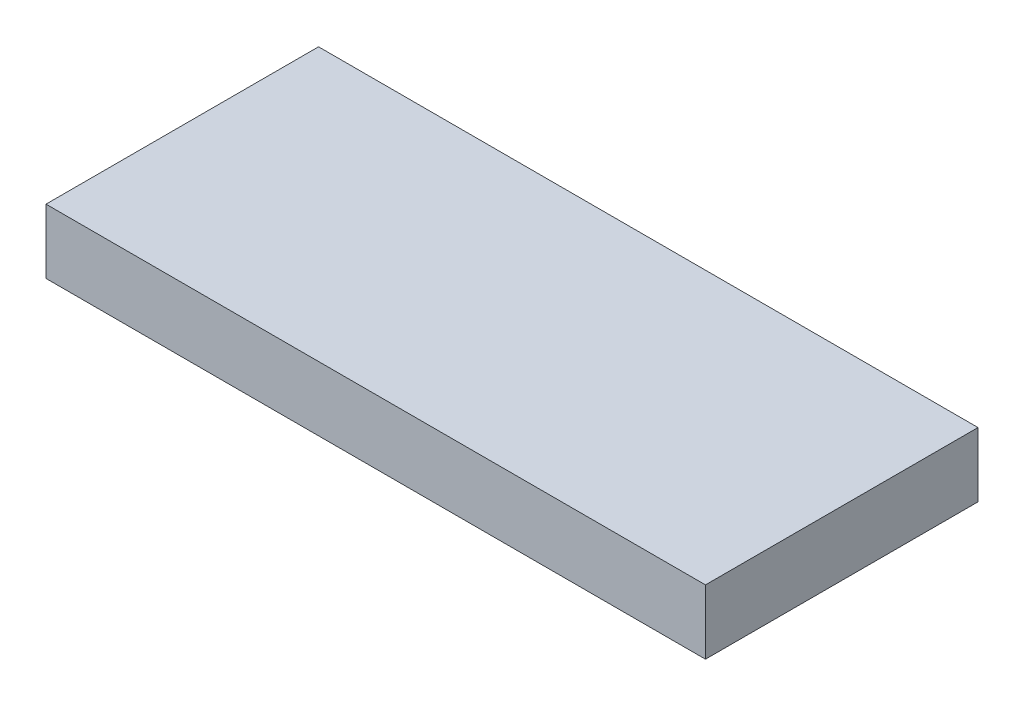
from build123d import *

# Parameters (mm, degrees)
SKETCH1_W           = 30.73
SKETCH1_H           = 12.7
BOSS_EXTRUDE1_DEPTH = 3


with BuildPart() as part:
    # Sketch1 → Boss-Extrude1 (new body)
    with BuildSketch(Plane(origin=(0, 0, 0), x_dir=(1, 0, 0), z_dir=(0, 1, 0))):
        Rectangle(SKETCH1_W, SKETCH1_H)
    extrude(amount=BOSS_EXTRUDE1_DEPTH)


solid = part.part
